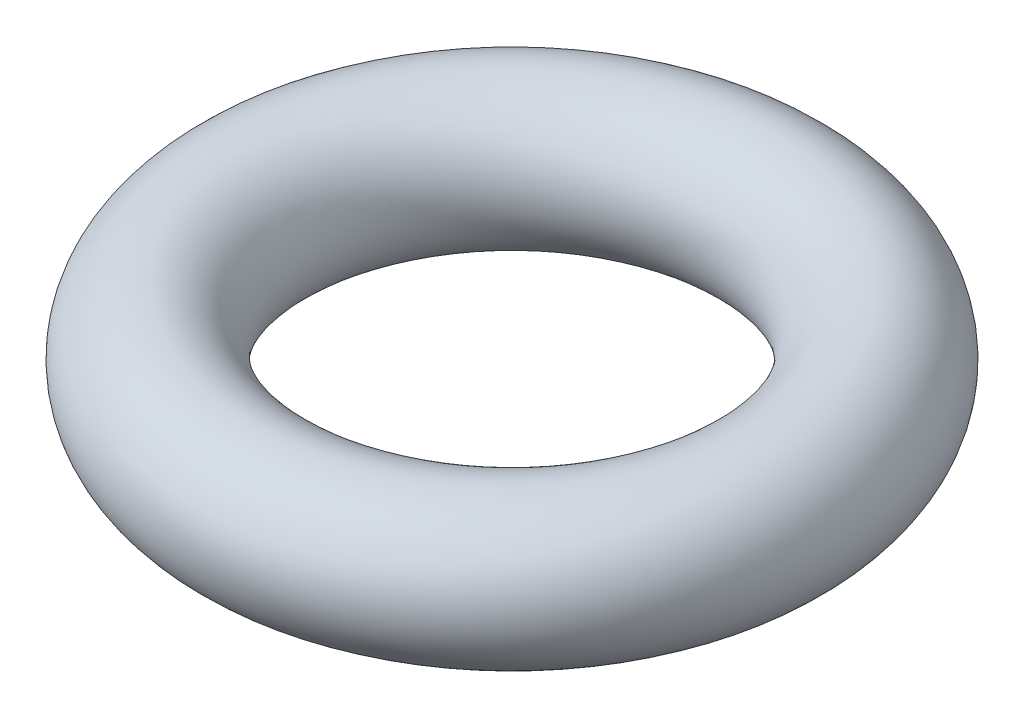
ISO-10303-21;
HEADER;
FILE_DESCRIPTION(('STEP AP214'),'2;1');
FILE_NAME('part.step','',(''),(''),'','','');
FILE_SCHEMA(('AUTOMOTIVE_DESIGN { 1 0 10303 214 1 1 1 1 }'));
ENDSEC;
DATA;
#1=APPLICATION_CONTEXT('core data for automotive mechanical design processes');
#2=APPLICATION_PROTOCOL_DEFINITION('international standard','automotive_design',2000,#1);
#3=PRODUCT_CONTEXT('',#1,'mechanical');
#4=PRODUCT('Part','Part','',(#3));
#5=PRODUCT_RELATED_PRODUCT_CATEGORY('part','',(#4));
#6=PRODUCT_DEFINITION_FORMATION('','',#4);
#7=PRODUCT_DEFINITION_CONTEXT('part definition',#1,'design');
#8=PRODUCT_DEFINITION('design','',#6,#7);
#9=PRODUCT_DEFINITION_SHAPE('','',#8);
#10=(LENGTH_UNIT() NAMED_UNIT(*) SI_UNIT(.MILLI.,.METRE.));
#11=(NAMED_UNIT(*) PLANE_ANGLE_UNIT() SI_UNIT($,.RADIAN.));
#12=(NAMED_UNIT(*) SI_UNIT($,.STERADIAN.) SOLID_ANGLE_UNIT());
#13=UNCERTAINTY_MEASURE_WITH_UNIT(LENGTH_MEASURE(1.E-05),#10,'distance_accuracy_value','');
#14=(GEOMETRIC_REPRESENTATION_CONTEXT(3) GLOBAL_UNCERTAINTY_ASSIGNED_CONTEXT((#13)) GLOBAL_UNIT_ASSIGNED_CONTEXT((#10,
#11,#12)) REPRESENTATION_CONTEXT('',''));
#15=CARTESIAN_POINT('',(0.,0.,0.));
#16=DIRECTION('',(0.,0.,1.));
#17=DIRECTION('',(1.,0.,0.));
#18=AXIS2_PLACEMENT_3D('',#15,#16,#17);
#19=CARTESIAN_POINT('',(0.,0.95,0.));
#20=DIRECTION('',(0.,-1.,0.));
#21=DIRECTION('',(0.,0.,-1.));
#22=AXIS2_PLACEMENT_3D('',#19,#20,#21);
#23=TOROIDAL_SURFACE('',#22,3.4,0.950000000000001);
#24=CARTESIAN_POINT('',(0.,0.95,-4.35));
#25=VERTEX_POINT('',#24);
#26=VERTEX_LOOP('',#25);
#27=FACE_BOUND('',#26,.T.);
#28=ADVANCED_FACE('F30',(#27),#23,.T.);
#29=CLOSED_SHELL('',(#28));
#30=MANIFOLD_SOLID_BREP('B2',#29);
#31=ADVANCED_BREP_SHAPE_REPRESENTATION('',(#18,#30),#14);
#32=SHAPE_DEFINITION_REPRESENTATION(#9,#31);
ENDSEC;
END-ISO-10303-21;
